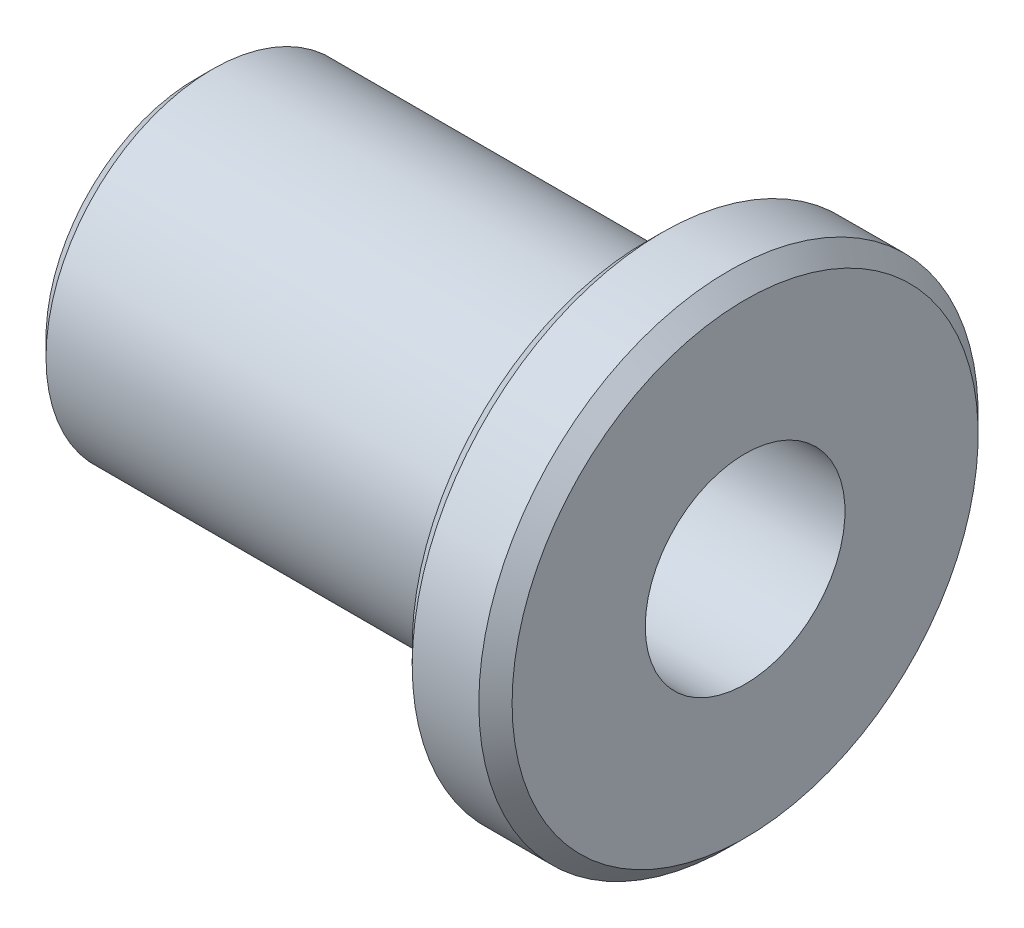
ISO-10303-21;
HEADER;
FILE_DESCRIPTION(('STEP AP214'),'2;1');
FILE_NAME('part.step','',(''),(''),'','','');
FILE_SCHEMA(('AUTOMOTIVE_DESIGN { 1 0 10303 214 1 1 1 1 }'));
ENDSEC;
DATA;
#1=APPLICATION_CONTEXT('core data for automotive mechanical design processes');
#2=APPLICATION_PROTOCOL_DEFINITION('international standard','automotive_design',2000,#1);
#3=PRODUCT_CONTEXT('',#1,'mechanical');
#4=PRODUCT('Part','Part','',(#3));
#5=PRODUCT_RELATED_PRODUCT_CATEGORY('part','',(#4));
#6=PRODUCT_DEFINITION_FORMATION('','',#4);
#7=PRODUCT_DEFINITION_CONTEXT('part definition',#1,'design');
#8=PRODUCT_DEFINITION('design','',#6,#7);
#9=PRODUCT_DEFINITION_SHAPE('','',#8);
#10=(LENGTH_UNIT() NAMED_UNIT(*) SI_UNIT(.MILLI.,.METRE.));
#11=(NAMED_UNIT(*) PLANE_ANGLE_UNIT() SI_UNIT($,.RADIAN.));
#12=(NAMED_UNIT(*) SI_UNIT($,.STERADIAN.) SOLID_ANGLE_UNIT());
#13=UNCERTAINTY_MEASURE_WITH_UNIT(LENGTH_MEASURE(1.E-05),#10,'distance_accuracy_value','');
#14=(GEOMETRIC_REPRESENTATION_CONTEXT(3) GLOBAL_UNCERTAINTY_ASSIGNED_CONTEXT((#13)) GLOBAL_UNIT_ASSIGNED_CONTEXT((#10,
#11,#12)) REPRESENTATION_CONTEXT('',''));
#15=CARTESIAN_POINT('',(0.,0.,0.));
#16=DIRECTION('',(0.,0.,1.));
#17=DIRECTION('',(1.,0.,0.));
#18=AXIS2_PLACEMENT_3D('',#15,#16,#17);
#19=CARTESIAN_POINT('',(0.,0.,0.));
#20=DIRECTION('',(-1.,0.,0.));
#21=DIRECTION('',(0.,0.,1.));
#22=AXIS2_PLACEMENT_3D('',#19,#20,#21);
#23=CYLINDRICAL_SURFACE('',#22,3.);
#24=CARTESIAN_POINT('',(0.500000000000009,0.,0.));
#25=DIRECTION('',(1.,0.,0.));
#26=DIRECTION('',(0.,0.,-1.));
#27=AXIS2_PLACEMENT_3D('',#24,#25,#26);
#28=CIRCLE('',#27,3.);
#29=CARTESIAN_POINT('',(0.500000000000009,0.,-3.));
#30=VERTEX_POINT('',#29);
#31=EDGE_CURVE('E49',#30,#30,#28,.F.);
#32=ORIENTED_EDGE('',*,*,#31,.T.);
#33=EDGE_LOOP('',(#32));
#34=FACE_BOUND('',#33,.T.);
#35=CARTESIAN_POINT('',(16.5,0.,0.));
#36=DIRECTION('',(-1.,0.,0.));
#37=DIRECTION('',(0.,0.,1.));
#38=AXIS2_PLACEMENT_3D('',#35,#36,#37);
#39=CIRCLE('',#38,3.);
#40=CARTESIAN_POINT('',(16.5,0.,3.));
#41=VERTEX_POINT('',#40);
#42=EDGE_CURVE('E64',#41,#41,#39,.T.);
#43=ORIENTED_EDGE('',*,*,#42,.F.);
#44=EDGE_LOOP('',(#43));
#45=FACE_BOUND('',#44,.T.);
#46=ADVANCED_FACE('F30',(#34,#45),#23,.F.);
#47=CARTESIAN_POINT('',(0.,3.,0.));
#48=DIRECTION('',(1.,0.,0.));
#49=DIRECTION('',(0.,0.,-1.));
#50=AXIS2_PLACEMENT_3D('',#47,#48,#49);
#51=PLANE('',#50);
#52=CARTESIAN_POINT('',(0.,0.,0.));
#53=DIRECTION('',(1.,0.,0.));
#54=DIRECTION('',(0.,0.,-1.));
#55=AXIS2_PLACEMENT_3D('',#52,#53,#54);
#56=CIRCLE('',#55,3.5);
#57=CARTESIAN_POINT('',(0.,0.,-3.5));
#58=VERTEX_POINT('',#57);
#59=EDGE_CURVE('E40',#58,#58,#56,.T.);
#60=ORIENTED_EDGE('',*,*,#59,.T.);
#61=EDGE_LOOP('',(#60));
#62=FACE_BOUND('',#61,.T.);
#63=CARTESIAN_POINT('',(0.,0.,0.));
#64=DIRECTION('',(1.,0.,0.));
#65=DIRECTION('',(0.,0.,-1.));
#66=AXIS2_PLACEMENT_3D('',#63,#64,#65);
#67=CIRCLE('',#66,4.49999999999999);
#68=CARTESIAN_POINT('',(0.,0.,-4.49999999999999));
#69=VERTEX_POINT('',#68);
#70=EDGE_CURVE('E44',#69,#69,#67,.F.);
#71=ORIENTED_EDGE('',*,*,#70,.T.);
#72=EDGE_LOOP('',(#71));
#73=FACE_BOUND('',#72,.T.);
#74=ADVANCED_FACE('F71',(#62,#73),#51,.F.);
#75=CARTESIAN_POINT('',(0.,0.,0.));
#76=DIRECTION('',(-1.,0.,0.));
#77=DIRECTION('',(0.,0.,1.));
#78=AXIS2_PLACEMENT_3D('',#75,#76,#77);
#79=CYLINDRICAL_SURFACE('',#78,5.);
#80=CARTESIAN_POINT('',(0.500000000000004,0.,0.));
#81=DIRECTION('',(1.,0.,0.));
#82=DIRECTION('',(0.,0.,-1.));
#83=AXIS2_PLACEMENT_3D('',#80,#81,#82);
#84=CIRCLE('',#83,5.);
#85=CARTESIAN_POINT('',(0.500000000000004,0.,-5.));
#86=VERTEX_POINT('',#85);
#87=EDGE_CURVE('E36',#86,#86,#84,.T.);
#88=ORIENTED_EDGE('',*,*,#87,.T.);
#89=EDGE_LOOP('',(#88));
#90=FACE_BOUND('',#89,.T.);
#91=CARTESIAN_POINT('',(13.5,0.,0.));
#92=DIRECTION('',(-1.,0.,0.));
#93=DIRECTION('',(0.,0.,1.));
#94=AXIS2_PLACEMENT_3D('',#91,#92,#93);
#95=CIRCLE('',#94,5.);
#96=CARTESIAN_POINT('',(13.5,0.,5.));
#97=VERTEX_POINT('',#96);
#98=EDGE_CURVE('E61',#97,#97,#95,.T.);
#99=ORIENTED_EDGE('',*,*,#98,.T.);
#100=EDGE_LOOP('',(#99));
#101=FACE_BOUND('',#100,.T.);
#102=ADVANCED_FACE('F76',(#90,#101),#79,.T.);
#103=CARTESIAN_POINT('',(13.5,5.,0.));
#104=DIRECTION('',(1.,0.,0.));
#105=DIRECTION('',(0.,0.,-1.));
#106=AXIS2_PLACEMENT_3D('',#103,#104,#105);
#107=PLANE('',#106);
#108=CARTESIAN_POINT('',(13.5,0.,0.));
#109=DIRECTION('',(1.,0.,0.));
#110=DIRECTION('',(0.,0.,-1.));
#111=AXIS2_PLACEMENT_3D('',#108,#109,#110);
#112=CIRCLE('',#111,6.99999999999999);
#113=CARTESIAN_POINT('',(13.5,0.,-6.99999999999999));
#114=VERTEX_POINT('',#113);
#115=EDGE_CURVE('E10',#114,#114,#112,.F.);
#116=ORIENTED_EDGE('',*,*,#115,.T.);
#117=EDGE_LOOP('',(#116));
#118=FACE_BOUND('',#117,.T.);
#119=ORIENTED_EDGE('',*,*,#98,.F.);
#120=EDGE_LOOP('',(#119));
#121=FACE_BOUND('',#120,.T.);
#122=ADVANCED_FACE('F104',(#118,#121),#107,.F.);
#123=CARTESIAN_POINT('',(0.,0.,0.));
#124=DIRECTION('',(-1.,0.,0.));
#125=DIRECTION('',(0.,0.,1.));
#126=AXIS2_PLACEMENT_3D('',#123,#124,#125);
#127=CYLINDRICAL_SURFACE('',#126,7.5);
#128=CARTESIAN_POINT('',(16.,0.,0.));
#129=DIRECTION('',(-1.,0.,0.));
#130=DIRECTION('',(0.,0.,1.));
#131=AXIS2_PLACEMENT_3D('',#128,#129,#130);
#132=CIRCLE('',#131,7.5);
#133=CARTESIAN_POINT('',(16.,0.,7.5));
#134=VERTEX_POINT('',#133);
#135=EDGE_CURVE('E55',#134,#134,#132,.T.);
#136=ORIENTED_EDGE('',*,*,#135,.T.);
#137=EDGE_LOOP('',(#136));
#138=FACE_BOUND('',#137,.T.);
#139=CARTESIAN_POINT('',(14.,0.,0.));
#140=DIRECTION('',(1.,0.,0.));
#141=DIRECTION('',(0.,0.,-1.));
#142=AXIS2_PLACEMENT_3D('',#139,#140,#141);
#143=CIRCLE('',#142,7.5);
#144=CARTESIAN_POINT('',(14.,0.,-7.5));
#145=VERTEX_POINT('',#144);
#146=EDGE_CURVE('E58',#145,#145,#143,.T.);
#147=ORIENTED_EDGE('',*,*,#146,.T.);
#148=EDGE_LOOP('',(#147));
#149=FACE_BOUND('',#148,.T.);
#150=ADVANCED_FACE('F100',(#138,#149),#127,.T.);
#151=CARTESIAN_POINT('',(16.5,7.5,0.));
#152=DIRECTION('',(-1.,0.,0.));
#153=DIRECTION('',(0.,0.,1.));
#154=AXIS2_PLACEMENT_3D('',#151,#152,#153);
#155=PLANE('',#154);
#156=CARTESIAN_POINT('',(16.5,0.,0.));
#157=DIRECTION('',(-1.,0.,0.));
#158=DIRECTION('',(0.,0.,1.));
#159=AXIS2_PLACEMENT_3D('',#156,#157,#158);
#160=CIRCLE('',#159,6.99999999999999);
#161=CARTESIAN_POINT('',(16.5,0.,6.99999999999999));
#162=VERTEX_POINT('',#161);
#163=EDGE_CURVE('E52',#162,#162,#160,.F.);
#164=ORIENTED_EDGE('',*,*,#163,.T.);
#165=EDGE_LOOP('',(#164));
#166=FACE_BOUND('',#165,.T.);
#167=ORIENTED_EDGE('',*,*,#42,.T.);
#168=EDGE_LOOP('',(#167));
#169=FACE_BOUND('',#168,.T.);
#170=ADVANCED_FACE('F68',(#166,#169),#155,.F.);
#171=CARTESIAN_POINT('',(16.,0.,0.));
#172=DIRECTION('',(-1.,0.,0.));
#173=DIRECTION('',(0.,0.,1.));
#174=AXIS2_PLACEMENT_3D('',#171,#172,#173);
#175=CONICAL_SURFACE('',#174,7.5,0.785398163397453);
#176=ORIENTED_EDGE('',*,*,#163,.F.);
#177=EDGE_LOOP('',(#176));
#178=FACE_BOUND('',#177,.T.);
#179=ORIENTED_EDGE('',*,*,#135,.F.);
#180=EDGE_LOOP('',(#179));
#181=FACE_BOUND('',#180,.T.);
#182=ADVANCED_FACE('F83',(#178,#181),#175,.T.);
#183=CARTESIAN_POINT('',(0.500000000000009,0.,0.));
#184=DIRECTION('',(-1.,0.,0.));
#185=DIRECTION('',(0.,0.,1.));
#186=AXIS2_PLACEMENT_3D('',#183,#184,#185);
#187=CONICAL_SURFACE('',#186,3.,0.785398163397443);
#188=ORIENTED_EDGE('',*,*,#59,.F.);
#189=EDGE_LOOP('',(#188));
#190=FACE_BOUND('',#189,.T.);
#191=ORIENTED_EDGE('',*,*,#31,.F.);
#192=EDGE_LOOP('',(#191));
#193=FACE_BOUND('',#192,.T.);
#194=ADVANCED_FACE('F80',(#190,#193),#187,.F.);
#195=CARTESIAN_POINT('',(0.,0.,0.));
#196=DIRECTION('',(1.,0.,0.));
#197=DIRECTION('',(0.,0.,-1.));
#198=AXIS2_PLACEMENT_3D('',#195,#196,#197);
#199=CONICAL_SURFACE('',#198,4.49999999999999,0.785398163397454);
#200=ORIENTED_EDGE('',*,*,#87,.F.);
#201=EDGE_LOOP('',(#200));
#202=FACE_BOUND('',#201,.T.);
#203=ORIENTED_EDGE('',*,*,#70,.F.);
#204=EDGE_LOOP('',(#203));
#205=FACE_BOUND('',#204,.T.);
#206=ADVANCED_FACE('F82',(#202,#205),#199,.T.);
#207=CARTESIAN_POINT('',(13.5,0.,0.));
#208=DIRECTION('',(1.,0.,0.));
#209=DIRECTION('',(0.,0.,-1.));
#210=AXIS2_PLACEMENT_3D('',#207,#208,#209);
#211=CONICAL_SURFACE('',#210,6.99999999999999,0.785398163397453);
#212=ORIENTED_EDGE('',*,*,#146,.F.);
#213=EDGE_LOOP('',(#212));
#214=FACE_BOUND('',#213,.T.);
#215=ORIENTED_EDGE('',*,*,#115,.F.);
#216=EDGE_LOOP('',(#215));
#217=FACE_BOUND('',#216,.T.);
#218=ADVANCED_FACE('F90',(#214,#217),#211,.T.);
#219=CLOSED_SHELL('',(#46,#74,#102,#122,#150,#170,#182,#194,#206,#218));
#220=MANIFOLD_SOLID_BREP('B2',#219);
#221=ADVANCED_BREP_SHAPE_REPRESENTATION('',(#18,#220),#14);
#222=SHAPE_DEFINITION_REPRESENTATION(#9,#221);
ENDSEC;
END-ISO-10303-21;
